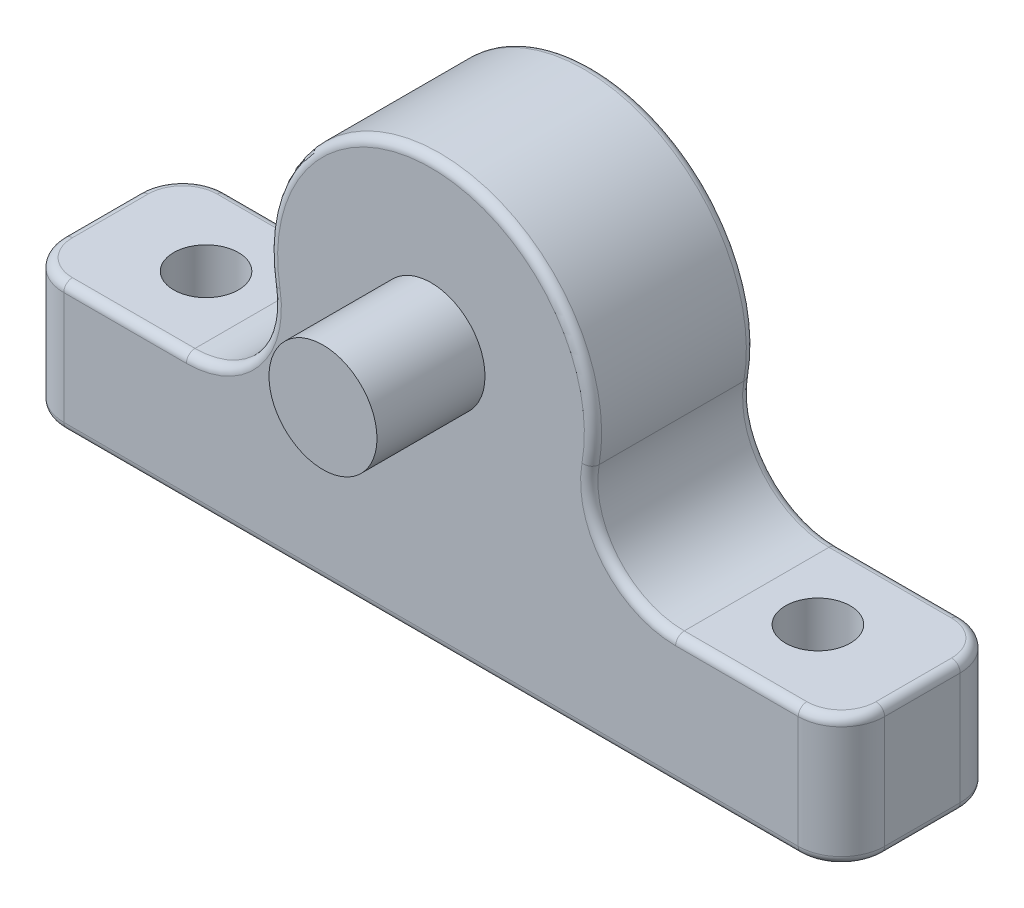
ISO-10303-21;
HEADER;
FILE_DESCRIPTION(('STEP AP214'),'2;1');
FILE_NAME('part.step','',(''),(''),'','','');
FILE_SCHEMA(('AUTOMOTIVE_DESIGN { 1 0 10303 214 1 1 1 1 }'));
ENDSEC;
DATA;
#1=APPLICATION_CONTEXT('core data for automotive mechanical design processes');
#2=APPLICATION_PROTOCOL_DEFINITION('international standard','automotive_design',2000,#1);
#3=PRODUCT_CONTEXT('',#1,'mechanical');
#4=PRODUCT('Part','Part','',(#3));
#5=PRODUCT_RELATED_PRODUCT_CATEGORY('part','',(#4));
#6=PRODUCT_DEFINITION_FORMATION('','',#4);
#7=PRODUCT_DEFINITION_CONTEXT('part definition',#1,'design');
#8=PRODUCT_DEFINITION('design','',#6,#7);
#9=PRODUCT_DEFINITION_SHAPE('','',#8);
#10=(LENGTH_UNIT() NAMED_UNIT(*) SI_UNIT(.MILLI.,.METRE.));
#11=(NAMED_UNIT(*) PLANE_ANGLE_UNIT() SI_UNIT($,.RADIAN.));
#12=(NAMED_UNIT(*) SI_UNIT($,.STERADIAN.) SOLID_ANGLE_UNIT());
#13=UNCERTAINTY_MEASURE_WITH_UNIT(LENGTH_MEASURE(1.E-05),#10,'distance_accuracy_value','');
#14=(GEOMETRIC_REPRESENTATION_CONTEXT(3) GLOBAL_UNCERTAINTY_ASSIGNED_CONTEXT((#13)) GLOBAL_UNIT_ASSIGNED_CONTEXT((#10,
#11,#12)) REPRESENTATION_CONTEXT('',''));
#15=CARTESIAN_POINT('',(0.,0.,0.));
#16=DIRECTION('',(0.,0.,1.));
#17=DIRECTION('',(1.,0.,0.));
#18=AXIS2_PLACEMENT_3D('',#15,#16,#17);
#19=CARTESIAN_POINT('',(0.,0.,37.5));
#20=DIRECTION('',(0.,0.,1.));
#21=DIRECTION('',(1.,0.,0.));
#22=AXIS2_PLACEMENT_3D('',#19,#20,#21);
#23=PLANE('',#22);
#24=DIRECTION('',(0.,-1.,0.));
#25=VECTOR('',#24,1.);
#26=CARTESIAN_POINT('',(-85.,0.,37.5));
#27=LINE('',#26,#25);
#28=CARTESIAN_POINT('',(-85.,-32.,37.5));
#29=VERTEX_POINT('',#28);
#30=CARTESIAN_POINT('',(-85.,-58.,37.5));
#31=VERTEX_POINT('',#30);
#32=EDGE_CURVE('E425',#29,#31,#27,.T.);
#33=ORIENTED_EDGE('',*,*,#32,.T.);
#34=DIRECTION('',(1.,0.,0.));
#35=VECTOR('',#34,1.);
#36=CARTESIAN_POINT('',(0.,-58.,37.5));
#37=LINE('',#36,#35);
#38=CARTESIAN_POINT('',(85.,-58.,37.5));
#39=VERTEX_POINT('',#38);
#40=EDGE_CURVE('E286',#31,#39,#37,.T.);
#41=ORIENTED_EDGE('',*,*,#40,.T.);
#42=DIRECTION('',(0.,1.,0.));
#43=VECTOR('',#42,1.);
#44=CARTESIAN_POINT('',(85.,0.,37.5));
#45=LINE('',#44,#43);
#46=CARTESIAN_POINT('',(85.,-32.,37.5));
#47=VERTEX_POINT('',#46);
#48=EDGE_CURVE('E428',#39,#47,#45,.T.);
#49=ORIENTED_EDGE('',*,*,#48,.T.);
#50=DIRECTION('',(-1.,0.,0.));
#51=VECTOR('',#50,1.);
#52=CARTESIAN_POINT('',(0.,-32.,37.5));
#53=LINE('',#52,#51);
#54=CARTESIAN_POINT('',(56.6237582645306,-32.,37.5));
#55=VERTEX_POINT('',#54);
#56=EDGE_CURVE('E284',#47,#55,#53,.T.);
#57=ORIENTED_EDGE('',*,*,#56,.T.);
#58=CARTESIAN_POINT('',(56.6237582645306,-10.,37.5));
#59=DIRECTION('',(0.,0.,1.));
#60=DIRECTION('',(1.,0.,0.));
#61=AXIS2_PLACEMENT_3D('',#58,#59,#60);
#62=CIRCLE('',#61,22.);
#63=CARTESIAN_POINT('',(34.9590159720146,-6.17391304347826,37.5));
#64=VERTEX_POINT('',#63);
#65=EDGE_CURVE('E282',#55,#64,#62,.F.);
#66=ORIENTED_EDGE('',*,*,#65,.T.);
#67=CARTESIAN_POINT('',(0.,0.,37.5));
#68=DIRECTION('',(0.,0.,1.));
#69=DIRECTION('',(1.,0.,0.));
#70=AXIS2_PLACEMENT_3D('',#67,#68,#69);
#71=CIRCLE('',#70,35.5);
#72=CARTESIAN_POINT('',(-34.9590159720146,-6.17391304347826,37.5));
#73=VERTEX_POINT('',#72);
#74=EDGE_CURVE('E280',#64,#73,#71,.T.);
#75=ORIENTED_EDGE('',*,*,#74,.T.);
#76=CARTESIAN_POINT('',(-56.6237582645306,-10.,37.5));
#77=DIRECTION('',(0.,0.,1.));
#78=DIRECTION('',(1.,0.,0.));
#79=AXIS2_PLACEMENT_3D('',#76,#77,#78);
#80=CIRCLE('',#79,22.);
#81=CARTESIAN_POINT('',(-56.6237582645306,-32.,37.5));
#82=VERTEX_POINT('',#81);
#83=EDGE_CURVE('E277',#73,#82,#80,.F.);
#84=ORIENTED_EDGE('',*,*,#83,.T.);
#85=DIRECTION('',(-1.,0.,0.));
#86=VECTOR('',#85,1.);
#87=CARTESIAN_POINT('',(0.,-32.,37.5));
#88=LINE('',#87,#86);
#89=EDGE_CURVE('E275',#82,#29,#88,.T.);
#90=ORIENTED_EDGE('',*,*,#89,.T.);
#91=EDGE_LOOP('',(#33,#41,#49,#57,#66,#75,#84,#90));
#92=FACE_BOUND('',#91,.T.);
#93=CARTESIAN_POINT('',(0.,0.,37.5));
#94=DIRECTION('',(0.,0.,1.));
#95=DIRECTION('',(1.,0.,0.));
#96=AXIS2_PLACEMENT_3D('',#93,#94,#95);
#97=CIRCLE('',#96,12.5);
#98=CARTESIAN_POINT('',(12.5,0.,37.5));
#99=VERTEX_POINT('',#98);
#100=EDGE_CURVE('E333',#99,#99,#97,.T.);
#101=ORIENTED_EDGE('',*,*,#100,.F.);
#102=EDGE_LOOP('',(#101));
#103=FACE_BOUND('',#102,.T.);
#104=ADVANCED_FACE('F36',(#92,#103),#23,.T.);
#105=CARTESIAN_POINT('',(0.,0.,37.5));
#106=DIRECTION('',(0.,0.,-1.));
#107=DIRECTION('',(-1.,0.,0.));
#108=AXIS2_PLACEMENT_3D('',#105,#106,#107);
#109=CYLINDRICAL_SURFACE('',#108,37.5);
#110=DIRECTION('',(0.,0.,-1.));
#111=VECTOR('',#110,1.);
#112=CARTESIAN_POINT('',(-36.9285379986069,-6.52173913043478,37.5));
#113=LINE('',#112,#111);
#114=CARTESIAN_POINT('',(-36.9285379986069,-6.52173913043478,2.));
#115=VERTEX_POINT('',#114);
#116=CARTESIAN_POINT('',(-36.9285379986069,-6.52173913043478,35.5));
#117=VERTEX_POINT('',#116);
#118=EDGE_CURVE('E404',#115,#117,#113,.F.);
#119=ORIENTED_EDGE('',*,*,#118,.T.);
#120=CARTESIAN_POINT('',(0.,0.,35.5));
#121=DIRECTION('',(0.,0.,1.));
#122=DIRECTION('',(1.,0.,0.));
#123=AXIS2_PLACEMENT_3D('',#120,#121,#122);
#124=CIRCLE('',#123,37.5);
#125=CARTESIAN_POINT('',(36.9285379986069,-6.52173913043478,35.5));
#126=VERTEX_POINT('',#125);
#127=EDGE_CURVE('E295',#117,#126,#124,.F.);
#128=ORIENTED_EDGE('',*,*,#127,.T.);
#129=DIRECTION('',(0.,0.,-1.));
#130=VECTOR('',#129,1.);
#131=CARTESIAN_POINT('',(36.9285379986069,-6.52173913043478,37.5));
#132=LINE('',#131,#130);
#133=CARTESIAN_POINT('',(36.9285379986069,-6.52173913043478,2.));
#134=VERTEX_POINT('',#133);
#135=EDGE_CURVE('E395',#126,#134,#132,.T.);
#136=ORIENTED_EDGE('',*,*,#135,.T.);
#137=CARTESIAN_POINT('',(0.,0.,2.));
#138=DIRECTION('',(0.,0.,1.));
#139=DIRECTION('',(1.,0.,0.));
#140=AXIS2_PLACEMENT_3D('',#137,#138,#139);
#141=CIRCLE('',#140,37.5);
#142=EDGE_CURVE('E293',#134,#115,#141,.T.);
#143=ORIENTED_EDGE('',*,*,#142,.T.);
#144=EDGE_LOOP('',(#119,#128,#136,#143));
#145=FACE_BOUND('',#144,.T.);
#146=ADVANCED_FACE('F401',(#145),#109,.T.);
#147=CARTESIAN_POINT('',(0.,0.,0.));
#148=DIRECTION('',(0.,0.,1.));
#149=DIRECTION('',(1.,0.,0.));
#150=AXIS2_PLACEMENT_3D('',#147,#148,#149);
#151=PLANE('',#150);
#152=DIRECTION('',(0.,-1.,0.));
#153=VECTOR('',#152,1.);
#154=CARTESIAN_POINT('',(85.,-60.,0.));
#155=LINE('',#154,#153);
#156=CARTESIAN_POINT('',(85.,-32.,0.));
#157=VERTEX_POINT('',#156);
#158=CARTESIAN_POINT('',(85.,-58.,0.));
#159=VERTEX_POINT('',#158);
#160=EDGE_CURVE('E413',#157,#159,#155,.T.);
#161=ORIENTED_EDGE('',*,*,#160,.T.);
#162=DIRECTION('',(-1.,0.,0.));
#163=VECTOR('',#162,1.);
#164=CARTESIAN_POINT('',(-85.,-58.,0.));
#165=LINE('',#164,#163);
#166=CARTESIAN_POINT('',(-85.,-58.,0.));
#167=VERTEX_POINT('',#166);
#168=EDGE_CURVE('E262',#159,#167,#165,.T.);
#169=ORIENTED_EDGE('',*,*,#168,.T.);
#170=DIRECTION('',(0.,1.,0.));
#171=VECTOR('',#170,1.);
#172=CARTESIAN_POINT('',(-85.,-30.,0.));
#173=LINE('',#172,#171);
#174=CARTESIAN_POINT('',(-85.,-32.,0.));
#175=VERTEX_POINT('',#174);
#176=EDGE_CURVE('E416',#167,#175,#173,.T.);
#177=ORIENTED_EDGE('',*,*,#176,.T.);
#178=DIRECTION('',(1.,0.,0.));
#179=VECTOR('',#178,1.);
#180=CARTESIAN_POINT('',(-56.6237582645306,-32.,0.));
#181=LINE('',#180,#179);
#182=CARTESIAN_POINT('',(-56.6237582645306,-32.,0.));
#183=VERTEX_POINT('',#182);
#184=EDGE_CURVE('E252',#175,#183,#181,.T.);
#185=ORIENTED_EDGE('',*,*,#184,.T.);
#186=CARTESIAN_POINT('',(-56.6237582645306,-10.,0.));
#187=DIRECTION('',(0.,0.,1.));
#188=DIRECTION('',(1.,0.,0.));
#189=AXIS2_PLACEMENT_3D('',#186,#187,#188);
#190=CIRCLE('',#189,22.);
#191=CARTESIAN_POINT('',(-34.9590159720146,-6.17391304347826,0.));
#192=VERTEX_POINT('',#191);
#193=EDGE_CURVE('E254',#183,#192,#190,.T.);
#194=ORIENTED_EDGE('',*,*,#193,.T.);
#195=CARTESIAN_POINT('',(0.,0.,0.));
#196=DIRECTION('',(0.,0.,1.));
#197=DIRECTION('',(1.,0.,0.));
#198=AXIS2_PLACEMENT_3D('',#195,#196,#197);
#199=CIRCLE('',#198,35.5);
#200=CARTESIAN_POINT('',(34.9590159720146,-6.17391304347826,0.));
#201=VERTEX_POINT('',#200);
#202=EDGE_CURVE('E256',#192,#201,#199,.F.);
#203=ORIENTED_EDGE('',*,*,#202,.T.);
#204=CARTESIAN_POINT('',(56.6237582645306,-10.,0.));
#205=DIRECTION('',(0.,0.,1.));
#206=DIRECTION('',(1.,0.,0.));
#207=AXIS2_PLACEMENT_3D('',#204,#205,#206);
#208=CIRCLE('',#207,22.);
#209=CARTESIAN_POINT('',(56.6237582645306,-32.,0.));
#210=VERTEX_POINT('',#209);
#211=EDGE_CURVE('E258',#201,#210,#208,.T.);
#212=ORIENTED_EDGE('',*,*,#211,.T.);
#213=DIRECTION('',(1.,0.,0.));
#214=VECTOR('',#213,1.);
#215=CARTESIAN_POINT('',(85.,-32.,0.));
#216=LINE('',#215,#214);
#217=EDGE_CURVE('E260',#210,#157,#216,.T.);
#218=ORIENTED_EDGE('',*,*,#217,.T.);
#219=EDGE_LOOP('',(#161,#169,#177,#185,#194,#203,#212,#218));
#220=FACE_BOUND('',#219,.T.);
#221=ADVANCED_FACE('F503',(#220),#151,.F.);
#222=CARTESIAN_POINT('',(0.,0.,62.5));
#223=DIRECTION('',(0.,0.,-1.));
#224=DIRECTION('',(-1.,0.,0.));
#225=AXIS2_PLACEMENT_3D('',#222,#223,#224);
#226=CYLINDRICAL_SURFACE('',#225,12.5);
#227=CARTESIAN_POINT('',(0.,0.,62.5));
#228=DIRECTION('',(0.,0.,1.));
#229=DIRECTION('',(1.,0.,0.));
#230=AXIS2_PLACEMENT_3D('',#227,#228,#229);
#231=CIRCLE('',#230,12.5);
#232=CARTESIAN_POINT('',(12.5,0.,62.5));
#233=VERTEX_POINT('',#232);
#234=EDGE_CURVE('E408',#233,#233,#231,.T.);
#235=ORIENTED_EDGE('',*,*,#234,.F.);
#236=EDGE_LOOP('',(#235));
#237=FACE_BOUND('',#236,.T.);
#238=ORIENTED_EDGE('',*,*,#100,.T.);
#239=EDGE_LOOP('',(#238));
#240=FACE_BOUND('',#239,.T.);
#241=ADVANCED_FACE('F507',(#237,#240),#226,.T.);
#242=CARTESIAN_POINT('',(0.,0.,62.5));
#243=DIRECTION('',(0.,0.,1.));
#244=DIRECTION('',(1.,0.,0.));
#245=AXIS2_PLACEMENT_3D('',#242,#243,#244);
#246=PLANE('',#245);
#247=ORIENTED_EDGE('',*,*,#234,.T.);
#248=EDGE_LOOP('',(#247));
#249=FACE_BOUND('',#248,.T.);
#250=ADVANCED_FACE('F697',(#249),#246,.T.);
#251=CARTESIAN_POINT('',(-95.,-30.,-192.353840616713));
#252=DIRECTION('',(0.,1.,0.));
#253=DIRECTION('',(0.,0.,1.));
#254=AXIS2_PLACEMENT_3D('',#251,#252,#253);
#255=PLANE('',#254);
#256=CARTESIAN_POINT('',(70.8118791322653,-30.,18.75));
#257=DIRECTION('',(0.,1.,0.));
#258=DIRECTION('',(0.,0.,1.));
#259=AXIS2_PLACEMENT_3D('',#256,#257,#258);
#260=CIRCLE('',#259,7.49999999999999);
#261=CARTESIAN_POINT('',(70.8118791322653,-30.,26.25));
#262=VERTEX_POINT('',#261);
#263=EDGE_CURVE('E886',#262,#262,#260,.T.);
#264=ORIENTED_EDGE('',*,*,#263,.F.);
#265=EDGE_LOOP('',(#264));
#266=FACE_BOUND('',#265,.T.);
#267=DIRECTION('',(0.,0.,-1.));
#268=VECTOR('',#267,1.);
#269=CARTESIAN_POINT('',(56.6237582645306,-30.,-192.353840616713));
#270=LINE('',#269,#268);
#271=CARTESIAN_POINT('',(56.6237582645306,-30.,2.));
#272=VERTEX_POINT('',#271);
#273=CARTESIAN_POINT('',(56.6237582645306,-30.,35.5));
#274=VERTEX_POINT('',#273);
#275=EDGE_CURVE('E398',#272,#274,#270,.F.);
#276=ORIENTED_EDGE('',*,*,#275,.T.);
#277=DIRECTION('',(-1.,0.,0.));
#278=VECTOR('',#277,1.);
#279=CARTESIAN_POINT('',(-95.,-30.,35.5));
#280=LINE('',#279,#278);
#281=CARTESIAN_POINT('',(85.,-30.,35.5));
#282=VERTEX_POINT('',#281);
#283=EDGE_CURVE('E309',#274,#282,#280,.F.);
#284=ORIENTED_EDGE('',*,*,#283,.T.);
#285=CARTESIAN_POINT('',(85.,-30.,27.5));
#286=DIRECTION('',(0.,1.,0.));
#287=DIRECTION('',(0.,0.,1.));
#288=AXIS2_PLACEMENT_3D('',#285,#286,#287);
#289=CIRCLE('',#288,8.);
#290=CARTESIAN_POINT('',(93.,-30.,27.5));
#291=VERTEX_POINT('',#290);
#292=EDGE_CURVE('E307',#282,#291,#289,.T.);
#293=ORIENTED_EDGE('',*,*,#292,.T.);
#294=DIRECTION('',(0.,0.,1.));
#295=VECTOR('',#294,1.);
#296=CARTESIAN_POINT('',(93.,-30.,-192.353840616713));
#297=LINE('',#296,#295);
#298=CARTESIAN_POINT('',(93.,-30.,10.));
#299=VERTEX_POINT('',#298);
#300=EDGE_CURVE('E305',#291,#299,#297,.F.);
#301=ORIENTED_EDGE('',*,*,#300,.T.);
#302=CARTESIAN_POINT('',(85.,-30.,10.));
#303=DIRECTION('',(0.,1.,0.));
#304=DIRECTION('',(0.,0.,1.));
#305=AXIS2_PLACEMENT_3D('',#302,#303,#304);
#306=CIRCLE('',#305,8.);
#307=CARTESIAN_POINT('',(85.,-30.,2.));
#308=VERTEX_POINT('',#307);
#309=EDGE_CURVE('E303',#299,#308,#306,.T.);
#310=ORIENTED_EDGE('',*,*,#309,.T.);
#311=DIRECTION('',(1.,0.,0.));
#312=VECTOR('',#311,1.);
#313=CARTESIAN_POINT('',(56.6237582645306,-30.,2.));
#314=LINE('',#313,#312);
#315=EDGE_CURVE('E301',#308,#272,#314,.F.);
#316=ORIENTED_EDGE('',*,*,#315,.T.);
#317=EDGE_LOOP('',(#276,#284,#293,#301,#310,#316));
#318=FACE_BOUND('',#317,.T.);
#319=ADVANCED_FACE('F701',(#266,#318),#255,.T.);
#320=CARTESIAN_POINT('',(-70.8118791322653,-30.,18.75));
#321=DIRECTION('',(0.,1.,0.));
#322=DIRECTION('',(0.,0.,1.));
#323=AXIS2_PLACEMENT_3D('',#320,#321,#322);
#324=CIRCLE('',#323,7.49999999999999);
#325=CARTESIAN_POINT('',(-70.8118791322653,-30.,26.25));
#326=VERTEX_POINT('',#325);
#327=EDGE_CURVE('E892',#326,#326,#324,.T.);
#328=ORIENTED_EDGE('',*,*,#327,.F.);
#329=EDGE_LOOP('',(#328));
#330=FACE_BOUND('',#329,.T.);
#331=DIRECTION('',(0.,0.,-1.));
#332=VECTOR('',#331,1.);
#333=CARTESIAN_POINT('',(-56.6237582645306,-30.,-192.353840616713));
#334=LINE('',#333,#332);
#335=CARTESIAN_POINT('',(-56.6237582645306,-30.,35.5));
#336=VERTEX_POINT('',#335);
#337=CARTESIAN_POINT('',(-56.6237582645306,-30.,2.));
#338=VERTEX_POINT('',#337);
#339=EDGE_CURVE('E406',#336,#338,#334,.T.);
#340=ORIENTED_EDGE('',*,*,#339,.T.);
#341=DIRECTION('',(1.,0.,0.));
#342=VECTOR('',#341,1.);
#343=CARTESIAN_POINT('',(-85.,-30.,2.));
#344=LINE('',#343,#342);
#345=CARTESIAN_POINT('',(-85.,-30.,2.));
#346=VERTEX_POINT('',#345);
#347=EDGE_CURVE('E11',#338,#346,#344,.F.);
#348=ORIENTED_EDGE('',*,*,#347,.T.);
#349=CARTESIAN_POINT('',(-85.,-30.,10.));
#350=DIRECTION('',(0.,1.,0.));
#351=DIRECTION('',(0.,0.,1.));
#352=AXIS2_PLACEMENT_3D('',#349,#350,#351);
#353=CIRCLE('',#352,8.);
#354=CARTESIAN_POINT('',(-93.,-30.,10.));
#355=VERTEX_POINT('',#354);
#356=EDGE_CURVE('E45',#346,#355,#353,.T.);
#357=ORIENTED_EDGE('',*,*,#356,.T.);
#358=DIRECTION('',(0.,0.,1.));
#359=VECTOR('',#358,1.);
#360=CARTESIAN_POINT('',(-93.,-30.,-192.353840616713));
#361=LINE('',#360,#359);
#362=CARTESIAN_POINT('',(-93.,-30.,27.5));
#363=VERTEX_POINT('',#362);
#364=EDGE_CURVE('E315',#355,#363,#361,.T.);
#365=ORIENTED_EDGE('',*,*,#364,.T.);
#366=CARTESIAN_POINT('',(-85.,-30.,27.5));
#367=DIRECTION('',(0.,1.,0.));
#368=DIRECTION('',(0.,0.,1.));
#369=AXIS2_PLACEMENT_3D('',#366,#367,#368);
#370=CIRCLE('',#369,8.);
#371=CARTESIAN_POINT('',(-85.,-30.,35.5));
#372=VERTEX_POINT('',#371);
#373=EDGE_CURVE('E313',#363,#372,#370,.T.);
#374=ORIENTED_EDGE('',*,*,#373,.T.);
#375=DIRECTION('',(-1.,0.,0.));
#376=VECTOR('',#375,1.);
#377=CARTESIAN_POINT('',(-95.,-30.,35.5));
#378=LINE('',#377,#376);
#379=EDGE_CURVE('E311',#372,#336,#378,.F.);
#380=ORIENTED_EDGE('',*,*,#379,.T.);
#381=EDGE_LOOP('',(#340,#348,#357,#365,#374,#380));
#382=FACE_BOUND('',#381,.T.);
#383=ADVANCED_FACE('F713',(#330,#382),#255,.T.);
#384=CARTESIAN_POINT('',(95.,-30.,-192.353840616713));
#385=DIRECTION('',(1.,0.,0.));
#386=DIRECTION('',(0.,0.,-1.));
#387=AXIS2_PLACEMENT_3D('',#384,#385,#386);
#388=PLANE('',#387);
#389=DIRECTION('',(0.,1.,0.));
#390=VECTOR('',#389,1.);
#391=CARTESIAN_POINT('',(95.,-30.,27.5));
#392=LINE('',#391,#390);
#393=CARTESIAN_POINT('',(95.,-32.,27.5));
#394=VERTEX_POINT('',#393);
#395=CARTESIAN_POINT('',(95.,-58.,27.5));
#396=VERTEX_POINT('',#395);
#397=EDGE_CURVE('E221',#394,#396,#392,.F.);
#398=ORIENTED_EDGE('',*,*,#397,.T.);
#399=DIRECTION('',(0.,0.,1.));
#400=VECTOR('',#399,1.);
#401=CARTESIAN_POINT('',(95.,-58.,-192.353840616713));
#402=LINE('',#401,#400);
#403=CARTESIAN_POINT('',(95.,-58.,10.));
#404=VERTEX_POINT('',#403);
#405=EDGE_CURVE('E270',#396,#404,#402,.F.);
#406=ORIENTED_EDGE('',*,*,#405,.T.);
#407=DIRECTION('',(0.,-1.,0.));
#408=VECTOR('',#407,1.);
#409=CARTESIAN_POINT('',(95.,-30.,10.));
#410=LINE('',#409,#408);
#411=CARTESIAN_POINT('',(95.,-32.,10.));
#412=VERTEX_POINT('',#411);
#413=EDGE_CURVE('E224',#404,#412,#410,.F.);
#414=ORIENTED_EDGE('',*,*,#413,.T.);
#415=DIRECTION('',(0.,0.,1.));
#416=VECTOR('',#415,1.);
#417=CARTESIAN_POINT('',(95.,-32.,-192.353840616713));
#418=LINE('',#417,#416);
#419=EDGE_CURVE('E268',#412,#394,#418,.T.);
#420=ORIENTED_EDGE('',*,*,#419,.T.);
#421=EDGE_LOOP('',(#398,#406,#414,#420));
#422=FACE_BOUND('',#421,.T.);
#423=ADVANCED_FACE('F434',(#422),#388,.T.);
#424=CARTESIAN_POINT('',(-95.,-60.,-192.353840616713));
#425=DIRECTION('',(0.,-1.,0.));
#426=DIRECTION('',(0.,0.,-1.));
#427=AXIS2_PLACEMENT_3D('',#424,#425,#426);
#428=PLANE('',#427);
#429=CARTESIAN_POINT('',(-70.8118791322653,-60.,18.75));
#430=DIRECTION('',(0.,1.,0.));
#431=DIRECTION('',(0.,0.,1.));
#432=AXIS2_PLACEMENT_3D('',#429,#430,#431);
#433=CIRCLE('',#432,7.49999999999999);
#434=CARTESIAN_POINT('',(-70.8118791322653,-60.,26.25));
#435=VERTEX_POINT('',#434);
#436=EDGE_CURVE('E889',#435,#435,#433,.T.);
#437=ORIENTED_EDGE('',*,*,#436,.T.);
#438=EDGE_LOOP('',(#437));
#439=FACE_BOUND('',#438,.T.);
#440=CARTESIAN_POINT('',(70.8118791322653,-60.,18.75));
#441=DIRECTION('',(0.,1.,0.));
#442=DIRECTION('',(0.,0.,1.));
#443=AXIS2_PLACEMENT_3D('',#440,#441,#442);
#444=CIRCLE('',#443,7.49999999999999);
#445=CARTESIAN_POINT('',(70.8118791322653,-60.,26.25));
#446=VERTEX_POINT('',#445);
#447=EDGE_CURVE('E337',#446,#446,#444,.T.);
#448=ORIENTED_EDGE('',*,*,#447,.T.);
#449=EDGE_LOOP('',(#448));
#450=FACE_BOUND('',#449,.T.);
#451=DIRECTION('',(1.,0.,0.));
#452=VECTOR('',#451,1.);
#453=CARTESIAN_POINT('',(-95.,-60.,35.5));
#454=LINE('',#453,#452);
#455=CARTESIAN_POINT('',(85.,-60.,35.5));
#456=VERTEX_POINT('',#455);
#457=CARTESIAN_POINT('',(-85.,-60.,35.5));
#458=VERTEX_POINT('',#457);
#459=EDGE_CURVE('E200',#456,#458,#454,.F.);
#460=ORIENTED_EDGE('',*,*,#459,.T.);
#461=CARTESIAN_POINT('',(-85.,-60.,27.5));
#462=DIRECTION('',(0.,-1.,0.));
#463=DIRECTION('',(0.,0.,-1.));
#464=AXIS2_PLACEMENT_3D('',#461,#462,#463);
#465=CIRCLE('',#464,8.);
#466=CARTESIAN_POINT('',(-93.,-60.,27.5));
#467=VERTEX_POINT('',#466);
#468=EDGE_CURVE('E237',#458,#467,#465,.T.);
#469=ORIENTED_EDGE('',*,*,#468,.T.);
#470=DIRECTION('',(0.,0.,1.));
#471=VECTOR('',#470,1.);
#472=CARTESIAN_POINT('',(-93.,-60.,-192.353840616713));
#473=LINE('',#472,#471);
#474=CARTESIAN_POINT('',(-93.,-60.,10.));
#475=VERTEX_POINT('',#474);
#476=EDGE_CURVE('E235',#467,#475,#473,.F.);
#477=ORIENTED_EDGE('',*,*,#476,.T.);
#478=CARTESIAN_POINT('',(-85.,-60.,10.));
#479=DIRECTION('',(0.,-1.,0.));
#480=DIRECTION('',(0.,0.,-1.));
#481=AXIS2_PLACEMENT_3D('',#478,#479,#480);
#482=CIRCLE('',#481,8.);
#483=CARTESIAN_POINT('',(-85.,-60.,2.));
#484=VERTEX_POINT('',#483);
#485=EDGE_CURVE('E233',#475,#484,#482,.T.);
#486=ORIENTED_EDGE('',*,*,#485,.T.);
#487=DIRECTION('',(-1.,0.,0.));
#488=VECTOR('',#487,1.);
#489=CARTESIAN_POINT('',(85.,-60.,2.));
#490=LINE('',#489,#488);
#491=CARTESIAN_POINT('',(85.,-60.,2.));
#492=VERTEX_POINT('',#491);
#493=EDGE_CURVE('E231',#484,#492,#490,.F.);
#494=ORIENTED_EDGE('',*,*,#493,.T.);
#495=CARTESIAN_POINT('',(85.,-60.,10.));
#496=DIRECTION('',(0.,-1.,0.));
#497=DIRECTION('',(0.,0.,-1.));
#498=AXIS2_PLACEMENT_3D('',#495,#496,#497);
#499=CIRCLE('',#498,8.);
#500=CARTESIAN_POINT('',(93.,-60.,10.));
#501=VERTEX_POINT('',#500);
#502=EDGE_CURVE('E229',#492,#501,#499,.T.);
#503=ORIENTED_EDGE('',*,*,#502,.T.);
#504=DIRECTION('',(0.,0.,1.));
#505=VECTOR('',#504,1.);
#506=CARTESIAN_POINT('',(93.,-60.,-192.353840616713));
#507=LINE('',#506,#505);
#508=CARTESIAN_POINT('',(93.,-60.,27.5));
#509=VERTEX_POINT('',#508);
#510=EDGE_CURVE('E203',#501,#509,#507,.T.);
#511=ORIENTED_EDGE('',*,*,#510,.T.);
#512=CARTESIAN_POINT('',(85.,-60.,27.5));
#513=DIRECTION('',(0.,-1.,0.));
#514=DIRECTION('',(0.,0.,-1.));
#515=AXIS2_PLACEMENT_3D('',#512,#513,#514);
#516=CIRCLE('',#515,8.);
#517=EDGE_CURVE('E195',#509,#456,#516,.T.);
#518=ORIENTED_EDGE('',*,*,#517,.T.);
#519=EDGE_LOOP('',(#460,#469,#477,#486,#494,#503,#511,#518));
#520=FACE_BOUND('',#519,.T.);
#521=ADVANCED_FACE('F197',(#439,#450,#520),#428,.T.);
#522=CARTESIAN_POINT('',(-95.,-30.,-192.353840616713));
#523=DIRECTION('',(-1.,0.,0.));
#524=DIRECTION('',(0.,-1.,0.));
#525=AXIS2_PLACEMENT_3D('',#522,#523,#524);
#526=PLANE('',#525);
#527=DIRECTION('',(0.,1.,0.));
#528=VECTOR('',#527,1.);
#529=CARTESIAN_POINT('',(-95.,-60.,10.));
#530=LINE('',#529,#528);
#531=CARTESIAN_POINT('',(-95.,-32.,10.));
#532=VERTEX_POINT('',#531);
#533=CARTESIAN_POINT('',(-95.,-58.,10.));
#534=VERTEX_POINT('',#533);
#535=EDGE_CURVE('E422',#532,#534,#530,.F.);
#536=ORIENTED_EDGE('',*,*,#535,.T.);
#537=DIRECTION('',(0.,0.,1.));
#538=VECTOR('',#537,1.);
#539=CARTESIAN_POINT('',(-95.,-58.,-192.353840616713));
#540=LINE('',#539,#538);
#541=CARTESIAN_POINT('',(-95.,-58.,27.5));
#542=VERTEX_POINT('',#541);
#543=EDGE_CURVE('E246',#534,#542,#540,.T.);
#544=ORIENTED_EDGE('',*,*,#543,.T.);
#545=DIRECTION('',(0.,-1.,0.));
#546=VECTOR('',#545,1.);
#547=CARTESIAN_POINT('',(-95.,-30.,27.5));
#548=LINE('',#547,#546);
#549=CARTESIAN_POINT('',(-95.,-32.,27.5));
#550=VERTEX_POINT('',#549);
#551=EDGE_CURVE('E419',#542,#550,#548,.F.);
#552=ORIENTED_EDGE('',*,*,#551,.T.);
#553=DIRECTION('',(0.,0.,1.));
#554=VECTOR('',#553,1.);
#555=CARTESIAN_POINT('',(-95.,-32.,-192.353840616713));
#556=LINE('',#555,#554);
#557=EDGE_CURVE('E244',#550,#532,#556,.F.);
#558=ORIENTED_EDGE('',*,*,#557,.T.);
#559=EDGE_LOOP('',(#536,#544,#552,#558));
#560=FACE_BOUND('',#559,.T.);
#561=ADVANCED_FACE('F515',(#560),#526,.T.);
#562=CARTESIAN_POINT('',(56.6237582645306,-10.,37.5));
#563=DIRECTION('',(0.,0.,-1.));
#564=DIRECTION('',(-1.,0.,0.));
#565=AXIS2_PLACEMENT_3D('',#562,#563,#564);
#566=CYLINDRICAL_SURFACE('',#565,20.);
#567=ORIENTED_EDGE('',*,*,#135,.F.);
#568=CARTESIAN_POINT('',(56.6237582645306,-10.,35.5));
#569=DIRECTION('',(0.,0.,1.));
#570=DIRECTION('',(1.,0.,0.));
#571=AXIS2_PLACEMENT_3D('',#568,#569,#570);
#572=CIRCLE('',#571,20.);
#573=EDGE_CURVE('E299',#126,#274,#572,.T.);
#574=ORIENTED_EDGE('',*,*,#573,.T.);
#575=ORIENTED_EDGE('',*,*,#275,.F.);
#576=CARTESIAN_POINT('',(56.6237582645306,-10.,2.));
#577=DIRECTION('',(0.,0.,1.));
#578=DIRECTION('',(1.,0.,0.));
#579=AXIS2_PLACEMENT_3D('',#576,#577,#578);
#580=CIRCLE('',#579,20.);
#581=EDGE_CURVE('E297',#272,#134,#580,.F.);
#582=ORIENTED_EDGE('',*,*,#581,.T.);
#583=EDGE_LOOP('',(#567,#574,#575,#582));
#584=FACE_BOUND('',#583,.T.);
#585=ADVANCED_FACE('F394',(#584),#566,.F.);
#586=CARTESIAN_POINT('',(-56.6237582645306,-10.,37.5));
#587=DIRECTION('',(0.,0.,-1.));
#588=DIRECTION('',(-1.,0.,0.));
#589=AXIS2_PLACEMENT_3D('',#586,#587,#588);
#590=CYLINDRICAL_SURFACE('',#589,20.);
#591=ORIENTED_EDGE('',*,*,#339,.F.);
#592=CARTESIAN_POINT('',(-56.6237582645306,-10.,35.5));
#593=DIRECTION('',(0.,0.,1.));
#594=DIRECTION('',(1.,0.,0.));
#595=AXIS2_PLACEMENT_3D('',#592,#593,#594);
#596=CIRCLE('',#595,20.);
#597=EDGE_CURVE('E290',#336,#117,#596,.T.);
#598=ORIENTED_EDGE('',*,*,#597,.T.);
#599=ORIENTED_EDGE('',*,*,#118,.F.);
#600=CARTESIAN_POINT('',(-56.6237582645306,-10.,2.));
#601=DIRECTION('',(0.,0.,1.));
#602=DIRECTION('',(1.,0.,0.));
#603=AXIS2_PLACEMENT_3D('',#600,#601,#602);
#604=CIRCLE('',#603,20.);
#605=EDGE_CURVE('E288',#115,#338,#604,.F.);
#606=ORIENTED_EDGE('',*,*,#605,.T.);
#607=EDGE_LOOP('',(#591,#598,#599,#606));
#608=FACE_BOUND('',#607,.T.);
#609=ADVANCED_FACE('F514',(#608),#590,.F.);
#610=CARTESIAN_POINT('',(-85.,0.,10.));
#611=DIRECTION('',(0.,-1.,0.));
#612=DIRECTION('',(1.,0.,0.));
#613=AXIS2_PLACEMENT_3D('',#610,#611,#612);
#614=CYLINDRICAL_SURFACE('',#613,10.);
#615=ORIENTED_EDGE('',*,*,#176,.F.);
#616=CARTESIAN_POINT('',(-85.,-58.,10.));
#617=DIRECTION('',(0.,-1.,0.));
#618=DIRECTION('',(0.,0.,-1.));
#619=AXIS2_PLACEMENT_3D('',#616,#617,#618);
#620=CIRCLE('',#619,10.);
#621=EDGE_CURVE('E250',#167,#534,#620,.F.);
#622=ORIENTED_EDGE('',*,*,#621,.T.);
#623=ORIENTED_EDGE('',*,*,#535,.F.);
#624=CARTESIAN_POINT('',(-85.,-32.,10.));
#625=DIRECTION('',(0.,1.,0.));
#626=DIRECTION('',(0.,0.,1.));
#627=AXIS2_PLACEMENT_3D('',#624,#625,#626);
#628=CIRCLE('',#627,10.);
#629=EDGE_CURVE('E248',#532,#175,#628,.F.);
#630=ORIENTED_EDGE('',*,*,#629,.T.);
#631=EDGE_LOOP('',(#615,#622,#623,#630));
#632=FACE_BOUND('',#631,.T.);
#633=ADVANCED_FACE('F518',(#632),#614,.T.);
#634=CARTESIAN_POINT('',(85.,0.,27.5));
#635=DIRECTION('',(0.,1.,0.));
#636=DIRECTION('',(0.,0.,1.));
#637=AXIS2_PLACEMENT_3D('',#634,#635,#636);
#638=CYLINDRICAL_SURFACE('',#637,10.);
#639=ORIENTED_EDGE('',*,*,#48,.F.);
#640=CARTESIAN_POINT('',(85.,-58.,27.5));
#641=DIRECTION('',(0.,-1.,0.));
#642=DIRECTION('',(0.,0.,-1.));
#643=AXIS2_PLACEMENT_3D('',#640,#641,#642);
#644=CIRCLE('',#643,10.);
#645=EDGE_CURVE('E212',#39,#396,#644,.F.);
#646=ORIENTED_EDGE('',*,*,#645,.T.);
#647=ORIENTED_EDGE('',*,*,#397,.F.);
#648=CARTESIAN_POINT('',(85.,-32.,27.5));
#649=DIRECTION('',(0.,1.,0.));
#650=DIRECTION('',(0.,0.,1.));
#651=AXIS2_PLACEMENT_3D('',#648,#649,#650);
#652=CIRCLE('',#651,10.);
#653=EDGE_CURVE('E272',#394,#47,#652,.F.);
#654=ORIENTED_EDGE('',*,*,#653,.T.);
#655=EDGE_LOOP('',(#639,#646,#647,#654));
#656=FACE_BOUND('',#655,.T.);
#657=ADVANCED_FACE('F456',(#656),#638,.T.);
#658=CARTESIAN_POINT('',(85.,0.,10.));
#659=DIRECTION('',(0.,1.,0.));
#660=DIRECTION('',(0.,0.,1.));
#661=AXIS2_PLACEMENT_3D('',#658,#659,#660);
#662=CYLINDRICAL_SURFACE('',#661,10.);
#663=ORIENTED_EDGE('',*,*,#413,.F.);
#664=CARTESIAN_POINT('',(85.,-58.,10.));
#665=DIRECTION('',(0.,-1.,0.));
#666=DIRECTION('',(0.,0.,-1.));
#667=AXIS2_PLACEMENT_3D('',#664,#665,#666);
#668=CIRCLE('',#667,10.);
#669=EDGE_CURVE('E266',#404,#159,#668,.F.);
#670=ORIENTED_EDGE('',*,*,#669,.T.);
#671=ORIENTED_EDGE('',*,*,#160,.F.);
#672=CARTESIAN_POINT('',(85.,-32.,10.));
#673=DIRECTION('',(0.,1.,0.));
#674=DIRECTION('',(0.,0.,1.));
#675=AXIS2_PLACEMENT_3D('',#672,#673,#674);
#676=CIRCLE('',#675,10.);
#677=EDGE_CURVE('E264',#157,#412,#676,.F.);
#678=ORIENTED_EDGE('',*,*,#677,.T.);
#679=EDGE_LOOP('',(#663,#670,#671,#678));
#680=FACE_BOUND('',#679,.T.);
#681=ADVANCED_FACE('F525',(#680),#662,.T.);
#682=CARTESIAN_POINT('',(-85.,0.,27.5));
#683=DIRECTION('',(0.,-1.,0.));
#684=DIRECTION('',(1.,0.,0.));
#685=AXIS2_PLACEMENT_3D('',#682,#683,#684);
#686=CYLINDRICAL_SURFACE('',#685,10.);
#687=ORIENTED_EDGE('',*,*,#551,.F.);
#688=CARTESIAN_POINT('',(-85.,-58.,27.5));
#689=DIRECTION('',(0.,-1.,0.));
#690=DIRECTION('',(0.,0.,-1.));
#691=AXIS2_PLACEMENT_3D('',#688,#689,#690);
#692=CIRCLE('',#691,10.);
#693=EDGE_CURVE('E241',#542,#31,#692,.F.);
#694=ORIENTED_EDGE('',*,*,#693,.T.);
#695=ORIENTED_EDGE('',*,*,#32,.F.);
#696=CARTESIAN_POINT('',(-85.,-32.,27.5));
#697=DIRECTION('',(0.,1.,0.));
#698=DIRECTION('',(0.,0.,1.));
#699=AXIS2_PLACEMENT_3D('',#696,#697,#698);
#700=CIRCLE('',#699,10.);
#701=EDGE_CURVE('E239',#29,#550,#700,.F.);
#702=ORIENTED_EDGE('',*,*,#701,.T.);
#703=EDGE_LOOP('',(#687,#694,#695,#702));
#704=FACE_BOUND('',#703,.T.);
#705=ADVANCED_FACE('F464',(#704),#686,.T.);
#706=CARTESIAN_POINT('',(85.,-58.,10.));
#707=DIRECTION('',(0.,-1.,0.));
#708=DIRECTION('',(0.,0.,-1.));
#709=AXIS2_PLACEMENT_3D('',#706,#707,#708);
#710=TOROIDAL_SURFACE('',#709,8.,2.);
#711=CARTESIAN_POINT('',(85.,-58.,2.));
#712=DIRECTION('',(-1.,0.,0.));
#713=DIRECTION('',(0.,0.,1.));
#714=AXIS2_PLACEMENT_3D('',#711,#712,#713);
#715=CIRCLE('',#714,2.);
#716=EDGE_CURVE('E327',#159,#492,#715,.T.);
#717=ORIENTED_EDGE('',*,*,#716,.F.);
#718=ORIENTED_EDGE('',*,*,#669,.F.);
#719=CARTESIAN_POINT('',(93.,-58.,10.));
#720=DIRECTION('',(0.,0.,1.));
#721=DIRECTION('',(1.,0.,0.));
#722=AXIS2_PLACEMENT_3D('',#719,#720,#721);
#723=CIRCLE('',#722,2.);
#724=EDGE_CURVE('E330',#501,#404,#723,.T.);
#725=ORIENTED_EDGE('',*,*,#724,.F.);
#726=ORIENTED_EDGE('',*,*,#502,.F.);
#727=EDGE_LOOP('',(#717,#718,#725,#726));
#728=FACE_BOUND('',#727,.T.);
#729=ADVANCED_FACE('F487',(#728),#710,.T.);
#730=CARTESIAN_POINT('',(93.,-58.,-192.353840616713));
#731=DIRECTION('',(0.,0.,1.));
#732=DIRECTION('',(1.,0.,0.));
#733=AXIS2_PLACEMENT_3D('',#730,#731,#732);
#734=CYLINDRICAL_SURFACE('',#733,2.);
#735=ORIENTED_EDGE('',*,*,#724,.T.);
#736=ORIENTED_EDGE('',*,*,#405,.F.);
#737=CARTESIAN_POINT('',(93.,-58.,27.5));
#738=DIRECTION('',(0.,0.,1.));
#739=DIRECTION('',(1.,0.,0.));
#740=AXIS2_PLACEMENT_3D('',#737,#738,#739);
#741=CIRCLE('',#740,2.);
#742=EDGE_CURVE('E325',#509,#396,#741,.T.);
#743=ORIENTED_EDGE('',*,*,#742,.F.);
#744=ORIENTED_EDGE('',*,*,#510,.F.);
#745=EDGE_LOOP('',(#735,#736,#743,#744));
#746=FACE_BOUND('',#745,.T.);
#747=ADVANCED_FACE('F489',(#746),#734,.T.);
#748=CARTESIAN_POINT('',(0.,-58.,2.));
#749=DIRECTION('',(1.,0.,0.));
#750=DIRECTION('',(0.,0.,-1.));
#751=AXIS2_PLACEMENT_3D('',#748,#749,#750);
#752=CYLINDRICAL_SURFACE('',#751,2.);
#753=ORIENTED_EDGE('',*,*,#716,.T.);
#754=ORIENTED_EDGE('',*,*,#493,.F.);
#755=CARTESIAN_POINT('',(-85.,-58.,2.));
#756=DIRECTION('',(-1.,0.,0.));
#757=DIRECTION('',(0.,0.,1.));
#758=AXIS2_PLACEMENT_3D('',#755,#756,#757);
#759=CIRCLE('',#758,2.);
#760=EDGE_CURVE('E215',#167,#484,#759,.T.);
#761=ORIENTED_EDGE('',*,*,#760,.F.);
#762=ORIENTED_EDGE('',*,*,#168,.F.);
#763=EDGE_LOOP('',(#753,#754,#761,#762));
#764=FACE_BOUND('',#763,.T.);
#765=ADVANCED_FACE('F482',(#764),#752,.T.);
#766=CARTESIAN_POINT('',(85.,-58.,27.5));
#767=DIRECTION('',(0.,-1.,0.));
#768=DIRECTION('',(0.,0.,-1.));
#769=AXIS2_PLACEMENT_3D('',#766,#767,#768);
#770=TOROIDAL_SURFACE('',#769,8.,2.);
#771=ORIENTED_EDGE('',*,*,#742,.T.);
#772=ORIENTED_EDGE('',*,*,#645,.F.);
#773=CARTESIAN_POINT('',(85.,-58.,35.5));
#774=DIRECTION('',(-1.,0.,0.));
#775=DIRECTION('',(0.,0.,1.));
#776=AXIS2_PLACEMENT_3D('',#773,#774,#775);
#777=CIRCLE('',#776,2.);
#778=EDGE_CURVE('E210',#456,#39,#777,.T.);
#779=ORIENTED_EDGE('',*,*,#778,.F.);
#780=ORIENTED_EDGE('',*,*,#517,.F.);
#781=EDGE_LOOP('',(#771,#772,#779,#780));
#782=FACE_BOUND('',#781,.T.);
#783=ADVANCED_FACE('F211',(#782),#770,.T.);
#784=CARTESIAN_POINT('',(-85.,-58.,10.));
#785=DIRECTION('',(0.,-1.,0.));
#786=DIRECTION('',(0.,0.,-1.));
#787=AXIS2_PLACEMENT_3D('',#784,#785,#786);
#788=TOROIDAL_SURFACE('',#787,8.,2.);
#789=ORIENTED_EDGE('',*,*,#760,.T.);
#790=ORIENTED_EDGE('',*,*,#485,.F.);
#791=CARTESIAN_POINT('',(-93.,-58.,10.));
#792=DIRECTION('',(0.,0.,1.));
#793=DIRECTION('',(1.,0.,0.));
#794=AXIS2_PLACEMENT_3D('',#791,#792,#793);
#795=CIRCLE('',#794,2.);
#796=EDGE_CURVE('E216',#534,#475,#795,.T.);
#797=ORIENTED_EDGE('',*,*,#796,.F.);
#798=ORIENTED_EDGE('',*,*,#621,.F.);
#799=EDGE_LOOP('',(#789,#790,#797,#798));
#800=FACE_BOUND('',#799,.T.);
#801=ADVANCED_FACE('F477',(#800),#788,.T.);
#802=CARTESIAN_POINT('',(0.,-58.,35.5));
#803=DIRECTION('',(1.,0.,0.));
#804=DIRECTION('',(0.,0.,-1.));
#805=AXIS2_PLACEMENT_3D('',#802,#803,#804);
#806=CYLINDRICAL_SURFACE('',#805,2.);
#807=ORIENTED_EDGE('',*,*,#778,.T.);
#808=ORIENTED_EDGE('',*,*,#40,.F.);
#809=CARTESIAN_POINT('',(-85.,-58.,35.5));
#810=DIRECTION('',(-1.,0.,0.));
#811=DIRECTION('',(0.,0.,1.));
#812=AXIS2_PLACEMENT_3D('',#809,#810,#811);
#813=CIRCLE('',#812,2.);
#814=EDGE_CURVE('E219',#458,#31,#813,.T.);
#815=ORIENTED_EDGE('',*,*,#814,.F.);
#816=ORIENTED_EDGE('',*,*,#459,.F.);
#817=EDGE_LOOP('',(#807,#808,#815,#816));
#818=FACE_BOUND('',#817,.T.);
#819=ADVANCED_FACE('F218',(#818),#806,.T.);
#820=CARTESIAN_POINT('',(-93.,-58.,-192.353840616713));
#821=DIRECTION('',(0.,0.,1.));
#822=DIRECTION('',(1.,0.,0.));
#823=AXIS2_PLACEMENT_3D('',#820,#821,#822);
#824=CYLINDRICAL_SURFACE('',#823,2.);
#825=ORIENTED_EDGE('',*,*,#796,.T.);
#826=ORIENTED_EDGE('',*,*,#476,.F.);
#827=CARTESIAN_POINT('',(-93.,-58.,27.5));
#828=DIRECTION('',(0.,0.,1.));
#829=DIRECTION('',(1.,0.,0.));
#830=AXIS2_PLACEMENT_3D('',#827,#828,#829);
#831=CIRCLE('',#830,2.);
#832=EDGE_CURVE('E318',#542,#467,#831,.T.);
#833=ORIENTED_EDGE('',*,*,#832,.F.);
#834=ORIENTED_EDGE('',*,*,#543,.F.);
#835=EDGE_LOOP('',(#825,#826,#833,#834));
#836=FACE_BOUND('',#835,.T.);
#837=ADVANCED_FACE('F472',(#836),#824,.T.);
#838=CARTESIAN_POINT('',(-85.,-58.,27.5));
#839=DIRECTION('',(0.,-1.,0.));
#840=DIRECTION('',(0.,0.,-1.));
#841=AXIS2_PLACEMENT_3D('',#838,#839,#840);
#842=TOROIDAL_SURFACE('',#841,8.,2.);
#843=ORIENTED_EDGE('',*,*,#814,.T.);
#844=ORIENTED_EDGE('',*,*,#693,.F.);
#845=ORIENTED_EDGE('',*,*,#832,.T.);
#846=ORIENTED_EDGE('',*,*,#468,.F.);
#847=EDGE_LOOP('',(#843,#844,#845,#846));
#848=FACE_BOUND('',#847,.T.);
#849=ADVANCED_FACE('F468',(#848),#842,.T.);
#850=CARTESIAN_POINT('',(56.6237582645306,-10.,2.));
#851=DIRECTION('',(0.,0.,1.));
#852=DIRECTION('',(1.,0.,0.));
#853=AXIS2_PLACEMENT_3D('',#850,#851,#852);
#854=TOROIDAL_SURFACE('',#853,22.,2.);
#855=CARTESIAN_POINT('',(34.9590159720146,-6.17391304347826,2.));
#856=DIRECTION('',(0.173913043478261,0.984761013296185,0.));
#857=DIRECTION('',(-0.984761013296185,0.173913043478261,0.));
#858=AXIS2_PLACEMENT_3D('',#855,#856,#857);
#859=CIRCLE('',#858,2.);
#860=EDGE_CURVE('E374',#134,#201,#859,.T.);
#861=ORIENTED_EDGE('',*,*,#860,.F.);
#862=ORIENTED_EDGE('',*,*,#581,.F.);
#863=CARTESIAN_POINT('',(56.6237582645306,-32.,2.));
#864=DIRECTION('',(1.,0.,0.));
#865=DIRECTION('',(0.,0.,-1.));
#866=AXIS2_PLACEMENT_3D('',#863,#864,#865);
#867=CIRCLE('',#866,2.);
#868=EDGE_CURVE('E40',#210,#272,#867,.T.);
#869=ORIENTED_EDGE('',*,*,#868,.F.);
#870=ORIENTED_EDGE('',*,*,#211,.F.);
#871=EDGE_LOOP('',(#861,#862,#869,#870));
#872=FACE_BOUND('',#871,.T.);
#873=ADVANCED_FACE('F38',(#872),#854,.T.);
#874=CARTESIAN_POINT('',(0.,-32.,2.));
#875=DIRECTION('',(-1.,0.,0.));
#876=DIRECTION('',(0.,0.,1.));
#877=AXIS2_PLACEMENT_3D('',#874,#875,#876);
#878=CYLINDRICAL_SURFACE('',#877,2.);
#879=ORIENTED_EDGE('',*,*,#868,.T.);
#880=ORIENTED_EDGE('',*,*,#315,.F.);
#881=CARTESIAN_POINT('',(85.,-32.,2.));
#882=DIRECTION('',(1.,0.,0.));
#883=DIRECTION('',(0.,0.,-1.));
#884=AXIS2_PLACEMENT_3D('',#881,#882,#883);
#885=CIRCLE('',#884,2.);
#886=EDGE_CURVE('E372',#157,#308,#885,.T.);
#887=ORIENTED_EDGE('',*,*,#886,.F.);
#888=ORIENTED_EDGE('',*,*,#217,.F.);
#889=EDGE_LOOP('',(#879,#880,#887,#888));
#890=FACE_BOUND('',#889,.T.);
#891=ADVANCED_FACE('F385',(#890),#878,.T.);
#892=CARTESIAN_POINT('',(0.,0.,2.));
#893=DIRECTION('',(0.,0.,1.));
#894=DIRECTION('',(1.,0.,0.));
#895=AXIS2_PLACEMENT_3D('',#892,#893,#894);
#896=TOROIDAL_SURFACE('',#895,35.5,2.);
#897=ORIENTED_EDGE('',*,*,#860,.T.);
#898=ORIENTED_EDGE('',*,*,#202,.F.);
#899=CARTESIAN_POINT('',(-34.9590159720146,-6.17391304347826,2.));
#900=DIRECTION('',(0.173913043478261,-0.984761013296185,0.));
#901=DIRECTION('',(0.984761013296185,0.173913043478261,0.));
#902=AXIS2_PLACEMENT_3D('',#899,#900,#901);
#903=CIRCLE('',#902,2.);
#904=EDGE_CURVE('E369',#115,#192,#903,.T.);
#905=ORIENTED_EDGE('',*,*,#904,.F.);
#906=ORIENTED_EDGE('',*,*,#142,.F.);
#907=EDGE_LOOP('',(#897,#898,#905,#906));
#908=FACE_BOUND('',#907,.T.);
#909=ADVANCED_FACE('F570',(#908),#896,.T.);
#910=CARTESIAN_POINT('',(85.,-32.,10.));
#911=DIRECTION('',(0.,1.,0.));
#912=DIRECTION('',(0.,0.,1.));
#913=AXIS2_PLACEMENT_3D('',#910,#911,#912);
#914=TOROIDAL_SURFACE('',#913,8.,2.);
#915=ORIENTED_EDGE('',*,*,#886,.T.);
#916=ORIENTED_EDGE('',*,*,#309,.F.);
#917=CARTESIAN_POINT('',(93.,-32.,10.));
#918=DIRECTION('',(0.,0.,1.));
#919=DIRECTION('',(1.,0.,0.));
#920=AXIS2_PLACEMENT_3D('',#917,#918,#919);
#921=CIRCLE('',#920,2.);
#922=EDGE_CURVE('E366',#412,#299,#921,.T.);
#923=ORIENTED_EDGE('',*,*,#922,.F.);
#924=ORIENTED_EDGE('',*,*,#677,.F.);
#925=EDGE_LOOP('',(#915,#916,#923,#924));
#926=FACE_BOUND('',#925,.T.);
#927=ADVANCED_FACE('F443',(#926),#914,.T.);
#928=CARTESIAN_POINT('',(-56.6237582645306,-10.,2.));
#929=DIRECTION('',(0.,0.,1.));
#930=DIRECTION('',(1.,0.,0.));
#931=AXIS2_PLACEMENT_3D('',#928,#929,#930);
#932=TOROIDAL_SURFACE('',#931,22.,2.);
#933=ORIENTED_EDGE('',*,*,#904,.T.);
#934=ORIENTED_EDGE('',*,*,#193,.F.);
#935=CARTESIAN_POINT('',(-56.6237582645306,-32.,2.));
#936=DIRECTION('',(-1.,0.,0.));
#937=DIRECTION('',(0.,0.,1.));
#938=AXIS2_PLACEMENT_3D('',#935,#936,#937);
#939=CIRCLE('',#938,2.);
#940=EDGE_CURVE('E363',#338,#183,#939,.T.);
#941=ORIENTED_EDGE('',*,*,#940,.F.);
#942=ORIENTED_EDGE('',*,*,#605,.F.);
#943=EDGE_LOOP('',(#933,#934,#941,#942));
#944=FACE_BOUND('',#943,.T.);
#945=ADVANCED_FACE('F582',(#944),#932,.T.);
#946=CARTESIAN_POINT('',(93.,-32.,-192.353840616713));
#947=DIRECTION('',(0.,0.,1.));
#948=DIRECTION('',(1.,0.,0.));
#949=AXIS2_PLACEMENT_3D('',#946,#947,#948);
#950=CYLINDRICAL_SURFACE('',#949,2.);
#951=ORIENTED_EDGE('',*,*,#922,.T.);
#952=ORIENTED_EDGE('',*,*,#300,.F.);
#953=CARTESIAN_POINT('',(93.,-32.,27.5));
#954=DIRECTION('',(0.,0.,1.));
#955=DIRECTION('',(1.,0.,0.));
#956=AXIS2_PLACEMENT_3D('',#953,#954,#955);
#957=CIRCLE('',#956,2.);
#958=EDGE_CURVE('E360',#394,#291,#957,.T.);
#959=ORIENTED_EDGE('',*,*,#958,.F.);
#960=ORIENTED_EDGE('',*,*,#419,.F.);
#961=EDGE_LOOP('',(#951,#952,#959,#960));
#962=FACE_BOUND('',#961,.T.);
#963=ADVANCED_FACE('F447',(#962),#950,.T.);
#964=CARTESIAN_POINT('',(0.,-32.,2.));
#965=DIRECTION('',(-1.,0.,0.));
#966=DIRECTION('',(0.,0.,1.));
#967=AXIS2_PLACEMENT_3D('',#964,#965,#966);
#968=CYLINDRICAL_SURFACE('',#967,2.);
#969=ORIENTED_EDGE('',*,*,#940,.T.);
#970=ORIENTED_EDGE('',*,*,#184,.F.);
#971=CARTESIAN_POINT('',(-85.,-32.,2.));
#972=DIRECTION('',(-1.,0.,0.));
#973=DIRECTION('',(0.,0.,1.));
#974=AXIS2_PLACEMENT_3D('',#971,#972,#973);
#975=CIRCLE('',#974,2.);
#976=EDGE_CURVE('E357',#346,#175,#975,.T.);
#977=ORIENTED_EDGE('',*,*,#976,.F.);
#978=ORIENTED_EDGE('',*,*,#347,.F.);
#979=EDGE_LOOP('',(#969,#970,#977,#978));
#980=FACE_BOUND('',#979,.T.);
#981=ADVANCED_FACE('F596',(#980),#968,.T.);
#982=CARTESIAN_POINT('',(85.,-32.,27.5));
#983=DIRECTION('',(0.,1.,0.));
#984=DIRECTION('',(0.,0.,1.));
#985=AXIS2_PLACEMENT_3D('',#982,#983,#984);
#986=TOROIDAL_SURFACE('',#985,8.,2.);
#987=ORIENTED_EDGE('',*,*,#958,.T.);
#988=ORIENTED_EDGE('',*,*,#292,.F.);
#989=CARTESIAN_POINT('',(85.,-32.,35.5));
#990=DIRECTION('',(-1.,0.,0.));
#991=DIRECTION('',(0.,0.,1.));
#992=AXIS2_PLACEMENT_3D('',#989,#990,#991);
#993=CIRCLE('',#992,2.);
#994=EDGE_CURVE('E354',#47,#282,#993,.T.);
#995=ORIENTED_EDGE('',*,*,#994,.F.);
#996=ORIENTED_EDGE('',*,*,#653,.F.);
#997=EDGE_LOOP('',(#987,#988,#995,#996));
#998=FACE_BOUND('',#997,.T.);
#999=ADVANCED_FACE('F452',(#998),#986,.T.);
#1000=CARTESIAN_POINT('',(-85.,-32.,10.));
#1001=DIRECTION('',(0.,1.,0.));
#1002=DIRECTION('',(0.,0.,1.));
#1003=AXIS2_PLACEMENT_3D('',#1000,#1001,#1002);
#1004=TOROIDAL_SURFACE('',#1003,8.,2.);
#1005=ORIENTED_EDGE('',*,*,#976,.T.);
#1006=ORIENTED_EDGE('',*,*,#629,.F.);
#1007=CARTESIAN_POINT('',(-93.,-32.,10.));
#1008=DIRECTION('',(0.,0.,1.));
#1009=DIRECTION('',(1.,0.,0.));
#1010=AXIS2_PLACEMENT_3D('',#1007,#1008,#1009);
#1011=CIRCLE('',#1010,2.);
#1012=EDGE_CURVE('E351',#355,#532,#1011,.T.);
#1013=ORIENTED_EDGE('',*,*,#1012,.F.);
#1014=ORIENTED_EDGE('',*,*,#356,.F.);
#1015=EDGE_LOOP('',(#1005,#1006,#1013,#1014));
#1016=FACE_BOUND('',#1015,.T.);
#1017=ADVANCED_FACE('F610',(#1016),#1004,.T.);
#1018=CARTESIAN_POINT('',(0.,-32.,35.5));
#1019=DIRECTION('',(-1.,0.,0.));
#1020=DIRECTION('',(0.,0.,1.));
#1021=AXIS2_PLACEMENT_3D('',#1018,#1019,#1020);
#1022=CYLINDRICAL_SURFACE('',#1021,2.);
#1023=ORIENTED_EDGE('',*,*,#994,.T.);
#1024=ORIENTED_EDGE('',*,*,#283,.F.);
#1025=CARTESIAN_POINT('',(56.6237582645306,-32.,35.5));
#1026=DIRECTION('',(-1.,0.,0.));
#1027=DIRECTION('',(0.,0.,1.));
#1028=AXIS2_PLACEMENT_3D('',#1025,#1026,#1027);
#1029=CIRCLE('',#1028,2.);
#1030=EDGE_CURVE('E348',#55,#274,#1029,.T.);
#1031=ORIENTED_EDGE('',*,*,#1030,.F.);
#1032=ORIENTED_EDGE('',*,*,#56,.F.);
#1033=EDGE_LOOP('',(#1023,#1024,#1031,#1032));
#1034=FACE_BOUND('',#1033,.T.);
#1035=ADVANCED_FACE('F617',(#1034),#1022,.T.);
#1036=CARTESIAN_POINT('',(-93.,-32.,-192.353840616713));
#1037=DIRECTION('',(0.,0.,1.));
#1038=DIRECTION('',(1.,0.,0.));
#1039=AXIS2_PLACEMENT_3D('',#1036,#1037,#1038);
#1040=CYLINDRICAL_SURFACE('',#1039,2.);
#1041=ORIENTED_EDGE('',*,*,#1012,.T.);
#1042=ORIENTED_EDGE('',*,*,#557,.F.);
#1043=CARTESIAN_POINT('',(-93.,-32.,27.5));
#1044=DIRECTION('',(0.,0.,1.));
#1045=DIRECTION('',(1.,0.,0.));
#1046=AXIS2_PLACEMENT_3D('',#1043,#1044,#1045);
#1047=CIRCLE('',#1046,2.);
#1048=EDGE_CURVE('E345',#363,#550,#1047,.T.);
#1049=ORIENTED_EDGE('',*,*,#1048,.F.);
#1050=ORIENTED_EDGE('',*,*,#364,.F.);
#1051=EDGE_LOOP('',(#1041,#1042,#1049,#1050));
#1052=FACE_BOUND('',#1051,.T.);
#1053=ADVANCED_FACE('F625',(#1052),#1040,.T.);
#1054=CARTESIAN_POINT('',(56.6237582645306,-10.,35.5));
#1055=DIRECTION('',(0.,0.,1.));
#1056=DIRECTION('',(1.,0.,0.));
#1057=AXIS2_PLACEMENT_3D('',#1054,#1055,#1056);
#1058=TOROIDAL_SURFACE('',#1057,22.,2.);
#1059=ORIENTED_EDGE('',*,*,#1030,.T.);
#1060=ORIENTED_EDGE('',*,*,#573,.F.);
#1061=CARTESIAN_POINT('',(34.9590159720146,-6.17391304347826,35.5));
#1062=DIRECTION('',(0.173913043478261,0.984761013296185,0.));
#1063=DIRECTION('',(-0.984761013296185,0.173913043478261,0.));
#1064=AXIS2_PLACEMENT_3D('',#1061,#1062,#1063);
#1065=CIRCLE('',#1064,2.);
#1066=EDGE_CURVE('E342',#64,#126,#1065,.T.);
#1067=ORIENTED_EDGE('',*,*,#1066,.F.);
#1068=ORIENTED_EDGE('',*,*,#65,.F.);
#1069=EDGE_LOOP('',(#1059,#1060,#1067,#1068));
#1070=FACE_BOUND('',#1069,.T.);
#1071=ADVANCED_FACE('F633',(#1070),#1058,.T.);
#1072=CARTESIAN_POINT('',(-85.,-32.,27.5));
#1073=DIRECTION('',(0.,1.,0.));
#1074=DIRECTION('',(0.,0.,1.));
#1075=AXIS2_PLACEMENT_3D('',#1072,#1073,#1074);
#1076=TOROIDAL_SURFACE('',#1075,8.,2.);
#1077=ORIENTED_EDGE('',*,*,#1048,.T.);
#1078=ORIENTED_EDGE('',*,*,#701,.F.);
#1079=CARTESIAN_POINT('',(-85.,-32.,35.5));
#1080=DIRECTION('',(1.,0.,0.));
#1081=DIRECTION('',(0.,0.,-1.));
#1082=AXIS2_PLACEMENT_3D('',#1079,#1080,#1081);
#1083=CIRCLE('',#1082,2.);
#1084=EDGE_CURVE('E339',#372,#29,#1083,.T.);
#1085=ORIENTED_EDGE('',*,*,#1084,.F.);
#1086=ORIENTED_EDGE('',*,*,#373,.F.);
#1087=EDGE_LOOP('',(#1077,#1078,#1085,#1086));
#1088=FACE_BOUND('',#1087,.T.);
#1089=ADVANCED_FACE('F641',(#1088),#1076,.T.);
#1090=CARTESIAN_POINT('',(0.,0.,35.5));
#1091=DIRECTION('',(0.,0.,1.));
#1092=DIRECTION('',(1.,0.,0.));
#1093=AXIS2_PLACEMENT_3D('',#1090,#1091,#1092);
#1094=TOROIDAL_SURFACE('',#1093,35.5,2.);
#1095=ORIENTED_EDGE('',*,*,#1066,.T.);
#1096=ORIENTED_EDGE('',*,*,#127,.F.);
#1097=CARTESIAN_POINT('',(-34.9590159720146,-6.17391304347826,35.5));
#1098=DIRECTION('',(0.173913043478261,-0.984761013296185,0.));
#1099=DIRECTION('',(0.984761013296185,0.173913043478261,0.));
#1100=AXIS2_PLACEMENT_3D('',#1097,#1098,#1099);
#1101=CIRCLE('',#1100,2.);
#1102=EDGE_CURVE('E336',#73,#117,#1101,.T.);
#1103=ORIENTED_EDGE('',*,*,#1102,.F.);
#1104=ORIENTED_EDGE('',*,*,#74,.F.);
#1105=EDGE_LOOP('',(#1095,#1096,#1103,#1104));
#1106=FACE_BOUND('',#1105,.T.);
#1107=ADVANCED_FACE('F649',(#1106),#1094,.T.);
#1108=CARTESIAN_POINT('',(0.,-32.,35.5));
#1109=DIRECTION('',(-1.,0.,0.));
#1110=DIRECTION('',(0.,0.,1.));
#1111=AXIS2_PLACEMENT_3D('',#1108,#1109,#1110);
#1112=CYLINDRICAL_SURFACE('',#1111,2.);
#1113=ORIENTED_EDGE('',*,*,#1084,.T.);
#1114=ORIENTED_EDGE('',*,*,#89,.F.);
#1115=CARTESIAN_POINT('',(-56.6237582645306,-32.,35.5));
#1116=DIRECTION('',(1.,0.,0.));
#1117=DIRECTION('',(0.,0.,-1.));
#1118=AXIS2_PLACEMENT_3D('',#1115,#1116,#1117);
#1119=CIRCLE('',#1118,2.);
#1120=EDGE_CURVE('E334',#336,#82,#1119,.T.);
#1121=ORIENTED_EDGE('',*,*,#1120,.F.);
#1122=ORIENTED_EDGE('',*,*,#379,.F.);
#1123=EDGE_LOOP('',(#1113,#1114,#1121,#1122));
#1124=FACE_BOUND('',#1123,.T.);
#1125=ADVANCED_FACE('F657',(#1124),#1112,.T.);
#1126=CARTESIAN_POINT('',(-56.6237582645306,-10.,35.5));
#1127=DIRECTION('',(0.,0.,1.));
#1128=DIRECTION('',(1.,0.,0.));
#1129=AXIS2_PLACEMENT_3D('',#1126,#1127,#1128);
#1130=TOROIDAL_SURFACE('',#1129,22.,2.);
#1131=ORIENTED_EDGE('',*,*,#1102,.T.);
#1132=ORIENTED_EDGE('',*,*,#597,.F.);
#1133=ORIENTED_EDGE('',*,*,#1120,.T.);
#1134=ORIENTED_EDGE('',*,*,#83,.F.);
#1135=EDGE_LOOP('',(#1131,#1132,#1133,#1134));
#1136=FACE_BOUND('',#1135,.T.);
#1137=ADVANCED_FACE('F665',(#1136),#1130,.T.);
#1138=CARTESIAN_POINT('',(70.8118791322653,-30.,18.75));
#1139=DIRECTION('',(0.,1.,0.));
#1140=DIRECTION('',(0.,0.,1.));
#1141=AXIS2_PLACEMENT_3D('',#1138,#1139,#1140);
#1142=CYLINDRICAL_SURFACE('',#1141,7.49999999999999);
#1143=ORIENTED_EDGE('',*,*,#447,.F.);
#1144=EDGE_LOOP('',(#1143));
#1145=FACE_BOUND('',#1144,.T.);
#1146=ORIENTED_EDGE('',*,*,#263,.T.);
#1147=EDGE_LOOP('',(#1146));
#1148=FACE_BOUND('',#1147,.T.);
#1149=ADVANCED_FACE('F673',(#1145,#1148),#1142,.F.);
#1150=CARTESIAN_POINT('',(-70.8118791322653,-30.,18.75));
#1151=DIRECTION('',(0.,1.,0.));
#1152=DIRECTION('',(0.,0.,1.));
#1153=AXIS2_PLACEMENT_3D('',#1150,#1151,#1152);
#1154=CYLINDRICAL_SURFACE('',#1153,7.49999999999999);
#1155=ORIENTED_EDGE('',*,*,#436,.F.);
#1156=EDGE_LOOP('',(#1155));
#1157=FACE_BOUND('',#1156,.T.);
#1158=ORIENTED_EDGE('',*,*,#327,.T.);
#1159=EDGE_LOOP('',(#1158));
#1160=FACE_BOUND('',#1159,.T.);
#1161=ADVANCED_FACE('F682',(#1157,#1160),#1154,.F.);
#1162=CLOSED_SHELL('',(#104,#146,#221,#241,#250,#319,#383,#423,#521,#561,#585,#609,#633,#657,
#681,#705,#729,#747,#765,#783,#801,#819,#837,#849,#873,#891,#909,#927,#945,#963,#981,#999,#1017,
#1035,#1053,#1071,#1089,#1107,#1125,#1137,#1149,#1161));
#1163=MANIFOLD_SOLID_BREP('B2',#1162);
#1164=ADVANCED_BREP_SHAPE_REPRESENTATION('',(#18,#1163),#14);
#1165=SHAPE_DEFINITION_REPRESENTATION(#9,#1164);
ENDSEC;
END-ISO-10303-21;
